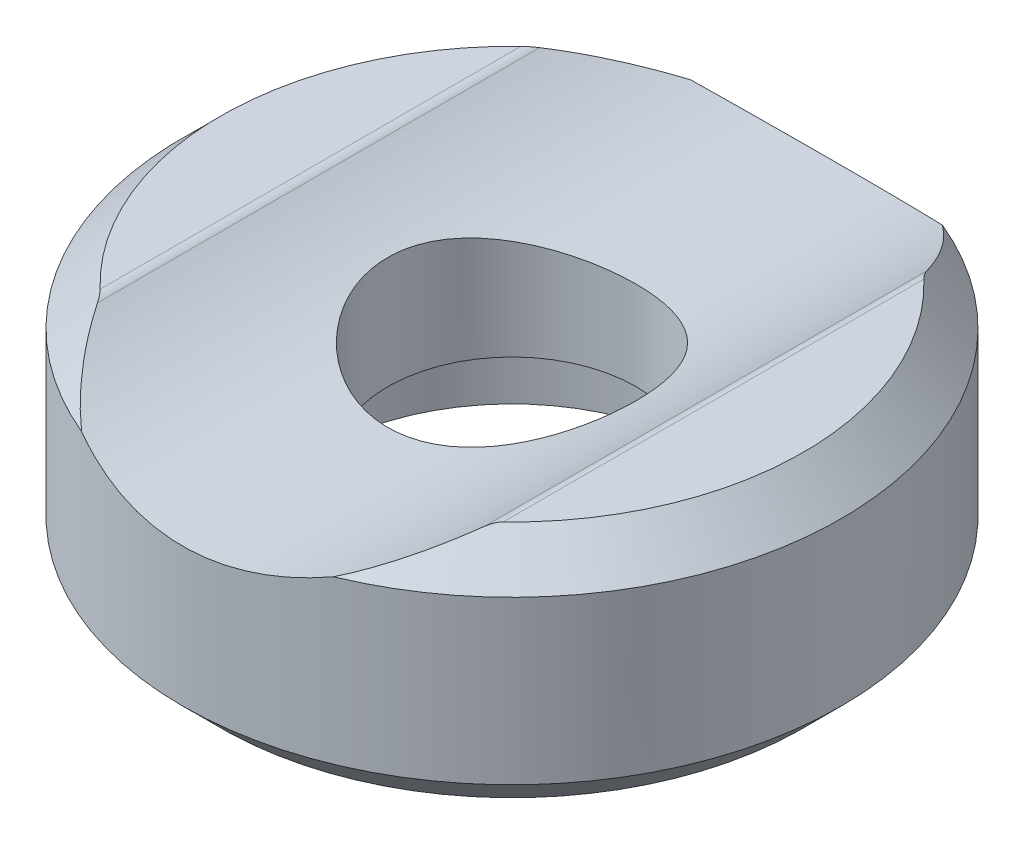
ISO-10303-21;
HEADER;
FILE_DESCRIPTION(('STEP AP214'),'2;1');
FILE_NAME('part.step','',(''),(''),'','','');
FILE_SCHEMA(('AUTOMOTIVE_DESIGN { 1 0 10303 214 1 1 1 1 }'));
ENDSEC;
DATA;
#1=APPLICATION_CONTEXT('core data for automotive mechanical design processes');
#2=APPLICATION_PROTOCOL_DEFINITION('international standard','automotive_design',2000,#1);
#3=PRODUCT_CONTEXT('',#1,'mechanical');
#4=PRODUCT('Part','Part','',(#3));
#5=PRODUCT_RELATED_PRODUCT_CATEGORY('part','',(#4));
#6=PRODUCT_DEFINITION_FORMATION('','',#4);
#7=PRODUCT_DEFINITION_CONTEXT('part definition',#1,'design');
#8=PRODUCT_DEFINITION('design','',#6,#7);
#9=PRODUCT_DEFINITION_SHAPE('','',#8);
#10=(LENGTH_UNIT() NAMED_UNIT(*) SI_UNIT(.MILLI.,.METRE.));
#11=(NAMED_UNIT(*) PLANE_ANGLE_UNIT() SI_UNIT($,.RADIAN.));
#12=(NAMED_UNIT(*) SI_UNIT($,.STERADIAN.) SOLID_ANGLE_UNIT());
#13=UNCERTAINTY_MEASURE_WITH_UNIT(LENGTH_MEASURE(1.E-05),#10,'distance_accuracy_value','');
#14=(GEOMETRIC_REPRESENTATION_CONTEXT(3) GLOBAL_UNCERTAINTY_ASSIGNED_CONTEXT((#13)) GLOBAL_UNIT_ASSIGNED_CONTEXT((#10,
#11,#12)) REPRESENTATION_CONTEXT('',''));
#15=CARTESIAN_POINT('',(0.,0.,0.));
#16=DIRECTION('',(0.,0.,1.));
#17=DIRECTION('',(1.,0.,0.));
#18=AXIS2_PLACEMENT_3D('',#15,#16,#17);
#19=CARTESIAN_POINT('',(6.1,5.,0.));
#20=DIRECTION('',(0.,1.,0.));
#21=DIRECTION('',(0.,0.,1.));
#22=AXIS2_PLACEMENT_3D('',#19,#20,#21);
#23=PLANE('',#22);
#24=CARTESIAN_POINT('',(0.,5.,0.));
#25=DIRECTION('',(0.,-1.,0.));
#26=DIRECTION('',(0.,0.,-1.));
#27=AXIS2_PLACEMENT_3D('',#24,#25,#26);
#28=CIRCLE('',#27,6.1);
#29=CARTESIAN_POINT('',(4.22018956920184,5.,-4.40454310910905));
#30=VERTEX_POINT('',#29);
#31=CARTESIAN_POINT('',(4.22018956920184,5.,4.40454310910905));
#32=VERTEX_POINT('',#31);
#33=EDGE_CURVE('E34',#30,#32,#28,.T.);
#34=ORIENTED_EDGE('',*,*,#33,.F.);
#35=DIRECTION('',(0.,0.,-1.));
#36=VECTOR('',#35,1.);
#37=CARTESIAN_POINT('',(4.22018956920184,5.,7.9));
#38=LINE('',#37,#36);
#39=EDGE_CURVE('E75',#32,#30,#38,.T.);
#40=ORIENTED_EDGE('',*,*,#39,.F.);
#41=EDGE_LOOP('',(#34,#40));
#42=FACE_BOUND('',#41,.T.);
#43=ADVANCED_FACE('F14',(#42),#23,.T.);
#44=CARTESIAN_POINT('',(0.,0.,0.));
#45=DIRECTION('',(0.,-1.,0.));
#46=DIRECTION('',(0.,0.,-1.));
#47=AXIS2_PLACEMENT_3D('',#44,#45,#46);
#48=CYLINDRICAL_SURFACE('',#47,2.6);
#49=CARTESIAN_POINT('',(0.,1.84120486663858,0.));
#50=DIRECTION('',(0.,-1.,0.));
#51=DIRECTION('',(0.,0.,-1.));
#52=AXIS2_PLACEMENT_3D('',#49,#50,#51);
#53=CIRCLE('',#52,2.6);
#54=CARTESIAN_POINT('',(0.,1.84120486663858,-2.6));
#55=VERTEX_POINT('',#54);
#56=EDGE_CURVE('E117',#55,#55,#53,.T.);
#57=ORIENTED_EDGE('',*,*,#56,.T.);
#58=EDGE_LOOP('',(#57));
#59=FACE_BOUND('',#58,.T.);
#60=CARTESIAN_POINT('',(0.,3.7,-2.6));
#61=CARTESIAN_POINT('',(-0.140962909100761,3.70000605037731,-2.59999190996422));
#62=CARTESIAN_POINT('',(-0.282062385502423,3.70418414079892,-2.58848178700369));
#63=CARTESIAN_POINT('',(-0.560216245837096,3.72047005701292,-2.54285009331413));
#64=CARTESIAN_POINT('',(-0.69726390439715,3.73259036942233,-2.5086929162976));
#65=CARTESIAN_POINT('',(-0.963033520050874,3.76344470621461,-2.41912735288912));
#66=CARTESIAN_POINT('',(-1.09177537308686,3.78216217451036,-2.36377213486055));
#67=CARTESIAN_POINT('',(-1.33809338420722,3.82432741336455,-2.23358991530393));
#68=CARTESIAN_POINT('',(-1.45567038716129,3.84777482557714,-2.15876438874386));
#69=CARTESIAN_POINT('',(-1.68107371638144,3.89801392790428,-1.98862772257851));
#70=CARTESIAN_POINT('',(-1.78839600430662,3.92489568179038,-1.89267554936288));
#71=CARTESIAN_POINT('',(-1.98582816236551,3.97851365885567,-1.68436679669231));
#72=CARTESIAN_POINT('',(-2.0759324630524,4.00524983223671,-1.57200492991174));
#73=CARTESIAN_POINT('',(-2.23944197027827,4.05657149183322,-1.32929956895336));
#74=CARTESIAN_POINT('',(-2.31215784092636,4.08104991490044,-1.1984667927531));
#75=CARTESIAN_POINT('',(-2.43433263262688,4.12369987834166,-0.925404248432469));
#76=CARTESIAN_POINT('',(-2.48380013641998,4.1418737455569,-0.783178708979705));
#77=CARTESIAN_POINT('',(-2.5561252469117,4.16890265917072,-0.497128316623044));
#78=CARTESIAN_POINT('',(-2.57993579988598,4.17809016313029,-0.353576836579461));
#79=CARTESIAN_POINT('',(-2.60325097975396,4.18708290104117,-0.0642446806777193));
#80=CARTESIAN_POINT('',(-2.60276474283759,4.1868916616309,0.0815351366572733));
#81=CARTESIAN_POINT('',(-2.57823271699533,4.17743683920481,0.362679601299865));
#82=CARTESIAN_POINT('',(-2.5554806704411,4.16867146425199,0.498176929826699));
#83=CARTESIAN_POINT('',(-2.48919169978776,4.14387952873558,0.763282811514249));
#84=CARTESIAN_POINT('',(-2.44565179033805,4.12785192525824,0.892890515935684));
#85=CARTESIAN_POINT('',(-2.33826565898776,4.09002253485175,1.14528025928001));
#86=CARTESIAN_POINT('',(-2.27406727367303,4.06812179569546,1.26789697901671));
#87=CARTESIAN_POINT('',(-2.12743465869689,4.02105106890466,1.50099824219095));
#88=CARTESIAN_POINT('',(-2.04499534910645,3.99588017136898,1.61147939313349));
#89=CARTESIAN_POINT('',(-1.85821397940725,3.94320396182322,1.82436526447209));
#90=CARTESIAN_POINT('',(-1.75283299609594,3.91565052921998,1.92584855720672));
#91=CARTESIAN_POINT('',(-1.52618194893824,3.86264982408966,2.10999844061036));
#92=CARTESIAN_POINT('',(-1.4049047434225,3.83720350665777,2.19265652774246));
#93=CARTESIAN_POINT('',(-1.14765531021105,3.79083684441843,2.3377343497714));
#94=CARTESIAN_POINT('',(-1.0115003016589,3.76998523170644,2.39985290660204));
#95=CARTESIAN_POINT('',(-0.729873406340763,3.73569358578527,2.49990401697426));
#96=CARTESIAN_POINT('',(-0.584421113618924,3.7222385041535,2.53788570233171));
#97=CARTESIAN_POINT('',(-0.364654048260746,3.70887469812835,2.57534270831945));
#98=CARTESIAN_POINT('',(-0.292083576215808,3.70555752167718,2.5845764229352));
#99=CARTESIAN_POINT('',(-0.146354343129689,3.70111860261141,2.59690716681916));
#100=CARTESIAN_POINT('',(-0.0731955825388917,3.69999685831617,2.60000420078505));
#101=CARTESIAN_POINT('',(0.140962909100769,3.70000605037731,2.59999190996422));
#102=CARTESIAN_POINT('',(0.282062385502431,3.70418414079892,2.58848178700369));
#103=CARTESIAN_POINT('',(0.560216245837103,3.72047005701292,2.54285009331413));
#104=CARTESIAN_POINT('',(0.697263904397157,3.73259036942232,2.5086929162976));
#105=CARTESIAN_POINT('',(0.963033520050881,3.7634447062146,2.41912735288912));
#106=CARTESIAN_POINT('',(1.09177537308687,3.78216217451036,2.36377213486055));
#107=CARTESIAN_POINT('',(1.33809338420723,3.82432741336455,2.23358991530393));
#108=CARTESIAN_POINT('',(1.4556703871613,3.84777482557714,2.15876438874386));
#109=CARTESIAN_POINT('',(1.68107371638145,3.89801392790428,1.9886277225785));
#110=CARTESIAN_POINT('',(1.78839600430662,3.92489568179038,1.89267554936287));
#111=CARTESIAN_POINT('',(1.98582816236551,3.97851365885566,1.68436679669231));
#112=CARTESIAN_POINT('',(2.0759324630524,4.00524983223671,1.57200492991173));
#113=CARTESIAN_POINT('',(2.23944197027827,4.05657149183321,1.32929956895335));
#114=CARTESIAN_POINT('',(2.31215784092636,4.08104991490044,1.19846679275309));
#115=CARTESIAN_POINT('',(2.43433263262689,4.12369987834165,0.925404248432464));
#116=CARTESIAN_POINT('',(2.48380013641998,4.14187374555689,0.783178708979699));
#117=CARTESIAN_POINT('',(2.5561252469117,4.16890265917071,0.497128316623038));
#118=CARTESIAN_POINT('',(2.57993579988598,4.17809016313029,0.353576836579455));
#119=CARTESIAN_POINT('',(2.60325097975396,4.18708290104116,0.0642446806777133));
#120=CARTESIAN_POINT('',(2.60276474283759,4.18689166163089,-0.081535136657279));
#121=CARTESIAN_POINT('',(2.57823271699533,4.17743683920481,-0.36267960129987));
#122=CARTESIAN_POINT('',(2.55548067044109,4.16867146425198,-0.498176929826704));
#123=CARTESIAN_POINT('',(2.48919169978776,4.14387952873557,-0.763282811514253));
#124=CARTESIAN_POINT('',(2.44565179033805,4.12785192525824,-0.892890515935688));
#125=CARTESIAN_POINT('',(2.33826565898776,4.09002253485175,-1.14528025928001));
#126=CARTESIAN_POINT('',(2.27406727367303,4.06812179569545,-1.26789697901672));
#127=CARTESIAN_POINT('',(2.12743465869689,4.02105106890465,-1.50099824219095));
#128=CARTESIAN_POINT('',(2.04499534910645,3.99588017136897,-1.6114793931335));
#129=CARTESIAN_POINT('',(1.85821397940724,3.94320396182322,-1.82436526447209));
#130=CARTESIAN_POINT('',(1.75283299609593,3.91565052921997,-1.92584855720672));
#131=CARTESIAN_POINT('',(1.52618194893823,3.86264982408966,-2.10999844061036));
#132=CARTESIAN_POINT('',(1.40490474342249,3.83720350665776,-2.19265652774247));
#133=CARTESIAN_POINT('',(1.14765531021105,3.79083684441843,-2.3377343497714));
#134=CARTESIAN_POINT('',(1.01150030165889,3.76998523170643,-2.39985290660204));
#135=CARTESIAN_POINT('',(0.729873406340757,3.73569358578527,-2.49990401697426));
#136=CARTESIAN_POINT('',(0.584421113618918,3.7222385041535,-2.53788570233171));
#137=CARTESIAN_POINT('',(0.364654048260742,3.70887469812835,-2.57534270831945));
#138=CARTESIAN_POINT('',(0.292083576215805,3.70555752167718,-2.5845764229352));
#139=CARTESIAN_POINT('',(0.146354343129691,3.70111860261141,-2.59690716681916));
#140=CARTESIAN_POINT('',(0.0731955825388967,3.69999685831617,-2.60000420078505));
#141=CARTESIAN_POINT('',(0.,3.7,-2.6));
#142=B_SPLINE_CURVE_WITH_KNOTS('',3,(#60,#61,#62,#63,#64,#65,#66,#67,#68,#69,#70,#71,#72,#73,
#74,#75,#76,#77,#78,#79,#80,#81,#82,#83,#84,#85,#86,#87,#88,#89,#90,#91,#92,#93,#94,#95,#96,#97,
#98,#99,#100,#101,#102,#103,#104,#105,#106,#107,#108,#109,#110,#111,#112,#113,#114,#115,#116,
#117,#118,#119,#120,#121,#122,#123,#124,#125,#126,#127,#128,#129,#130,#131,#132,#133,#134,#135,
#136,#137,#138,#139,#140,#141),.UNSPECIFIED.,.T.,.F.,(4,2,2,2,2,2,2,2,2,2,2,2,2,2,2,2,2,2,2,2,2,
2,2,2,2,2,2,2,2,2,2,2,2,2,2,2,2,2,2,2,4),(0.,0.422605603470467,0.845877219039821,
1.26809407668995,1.6902789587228,2.12767719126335,2.56521666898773,3.0179651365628,
3.47054632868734,3.90566763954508,4.34062533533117,4.75172489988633,5.16288352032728,
5.58145960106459,6.00015239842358,6.44472715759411,6.88950233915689,7.34053671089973,
7.79065001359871,8.01008991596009,8.22952965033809,8.65213525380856,9.07540686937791,
9.49762372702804,9.91980860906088,10.3572068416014,10.7947463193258,11.2474947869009,
11.7000759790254,12.1351972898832,12.5701549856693,12.9812545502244,13.3924131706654,
13.8109892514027,14.2296820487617,14.6742568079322,15.119031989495,15.5700663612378,
16.0201796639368,16.2396195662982,16.4590593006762),.UNSPECIFIED.);
#143=CARTESIAN_POINT('',(0.,3.7,-2.6));
#144=VERTEX_POINT('',#143);
#145=EDGE_CURVE('E96',#144,#144,#142,.T.);
#146=ORIENTED_EDGE('',*,*,#145,.T.);
#147=EDGE_LOOP('',(#146));
#148=FACE_BOUND('',#147,.T.);
#149=ADVANCED_FACE('F190',(#59,#148),#48,.F.);
#150=CARTESIAN_POINT('',(0.,0.,0.));
#151=DIRECTION('',(0.,-1.,0.));
#152=DIRECTION('',(0.,0.,-1.));
#153=AXIS2_PLACEMENT_3D('',#150,#151,#152);
#154=CYLINDRICAL_SURFACE('',#153,6.9);
#155=CARTESIAN_POINT('',(-2.63628526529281,4.2,-6.37651942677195));
#156=CARTESIAN_POINT('',(-2.50604413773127,4.14873605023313,-6.43038253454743));
#157=CARTESIAN_POINT('',(-2.37298216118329,4.10078254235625,-6.48070582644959));
#158=CARTESIAN_POINT('',(-2.10169319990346,4.01209649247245,-6.57369114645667));
#159=CARTESIAN_POINT('',(-1.96346058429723,3.97137211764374,-6.6163445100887));
#160=CARTESIAN_POINT('',(-1.68295064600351,3.89795362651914,-6.69318911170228));
#161=CARTESIAN_POINT('',(-1.54068420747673,3.86523984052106,-6.72740107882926));
#162=CARTESIAN_POINT('',(-1.25272939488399,3.80830128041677,-6.78691875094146));
#163=CARTESIAN_POINT('',(-1.10704340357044,3.78407077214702,-6.81223047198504));
#164=CARTESIAN_POINT('',(-0.802040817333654,3.7430345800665,-6.85508535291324));
#165=CARTESIAN_POINT('',(-0.642525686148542,3.7269277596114,-6.8718975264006));
#166=CARTESIAN_POINT('',(-0.322004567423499,3.70541128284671,-6.89435401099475));
#167=CARTESIAN_POINT('',(-0.160998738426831,3.70000050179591,-6.89999949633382));
#168=CARTESIAN_POINT('',(0.149636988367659,3.69999953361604,-6.90000046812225));
#169=CARTESIAN_POINT('',(0.29926785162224,3.70467267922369,-6.89512457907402));
#170=CARTESIAN_POINT('',(0.597387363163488,3.72327077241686,-6.87571451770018));
#171=CARTESIAN_POINT('',(0.745875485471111,3.73719974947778,-6.8611761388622));
#172=CARTESIAN_POINT('',(1.04078507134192,3.77406888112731,-6.82267727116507));
#173=CARTESIAN_POINT('',(1.18720188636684,3.79702673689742,-6.79869827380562));
#174=CARTESIAN_POINT('',(1.47659213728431,3.85149979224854,-6.74176705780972));
#175=CARTESIAN_POINT('',(1.61956675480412,3.88301200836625,-6.70881796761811));
#176=CARTESIAN_POINT('',(1.91220551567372,3.95680499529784,-6.63159845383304));
#177=CARTESIAN_POINT('',(2.06152582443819,3.99973239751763,-6.58664711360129));
#178=CARTESIAN_POINT('',(2.35372885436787,4.09386304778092,-6.4879666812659));
#179=CARTESIAN_POINT('',(2.49663793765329,4.14502747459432,-6.43427875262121));
#180=CARTESIAN_POINT('',(2.63628526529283,4.2,-6.37651942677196));
#181=B_SPLINE_CURVE_WITH_KNOTS('',3,(#155,#156,#157,#158,#159,#160,#161,#162,#163,#164,#165,
#166,#167,#168,#169,#170,#171,#172,#173,#174,#175,#176,#177,#178,#179,#180),.UNSPECIFIED.,.F.,
.F.,(4,2,2,2,2,2,2,2,2,2,2,2,4),(0.,0.449885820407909,0.900276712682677,1.34955034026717,
1.79851969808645,2.28139309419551,2.76421571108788,3.21296532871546,3.66191043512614,
4.11174012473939,4.56141313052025,5.04603822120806,5.52844275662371),.UNSPECIFIED.);
#182=CARTESIAN_POINT('',(-2.63628526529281,4.2,-6.37651942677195));
#183=VERTEX_POINT('',#182);
#184=CARTESIAN_POINT('',(2.63628526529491,4.20000000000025,-6.37651942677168));
#185=VERTEX_POINT('',#184);
#186=EDGE_CURVE('E181',#183,#185,#181,.T.);
#187=ORIENTED_EDGE('',*,*,#186,.T.);
#188=CARTESIAN_POINT('',(0.,4.2,0.));
#189=DIRECTION('',(0.,-1.,0.));
#190=DIRECTION('',(0.,0.,-1.));
#191=AXIS2_PLACEMENT_3D('',#188,#189,#190);
#192=CIRCLE('',#191,6.9);
#193=CARTESIAN_POINT('',(2.63628526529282,4.2,6.37651942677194));
#194=VERTEX_POINT('',#193);
#195=EDGE_CURVE('E93',#185,#194,#192,.T.);
#196=ORIENTED_EDGE('',*,*,#195,.T.);
#197=CARTESIAN_POINT('',(2.63628526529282,4.2,6.37651942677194));
#198=CARTESIAN_POINT('',(2.50604413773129,4.14873605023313,6.43038253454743));
#199=CARTESIAN_POINT('',(2.37298216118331,4.10078254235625,6.48070582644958));
#200=CARTESIAN_POINT('',(2.10169319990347,4.01209649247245,6.57369114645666));
#201=CARTESIAN_POINT('',(1.96346058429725,3.97137211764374,6.6163445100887));
#202=CARTESIAN_POINT('',(1.68295064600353,3.89795362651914,6.69318911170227));
#203=CARTESIAN_POINT('',(1.54068420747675,3.86523984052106,6.72740107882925));
#204=CARTESIAN_POINT('',(1.25272939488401,3.80830128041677,6.78691875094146));
#205=CARTESIAN_POINT('',(1.10704340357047,3.78407077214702,6.81223047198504));
#206=CARTESIAN_POINT('',(0.802040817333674,3.7430345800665,6.85508535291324));
#207=CARTESIAN_POINT('',(0.64252568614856,3.7269277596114,6.8718975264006));
#208=CARTESIAN_POINT('',(0.322004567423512,3.70541128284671,6.89435401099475));
#209=CARTESIAN_POINT('',(0.160998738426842,3.70000050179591,6.89999949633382));
#210=CARTESIAN_POINT('',(-0.149636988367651,3.69999953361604,6.90000046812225));
#211=CARTESIAN_POINT('',(-0.299267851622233,3.70467267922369,6.89512457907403));
#212=CARTESIAN_POINT('',(-0.59738736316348,3.72327077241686,6.87571451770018));
#213=CARTESIAN_POINT('',(-0.745875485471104,3.73719974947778,6.8611761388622));
#214=CARTESIAN_POINT('',(-1.04078507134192,3.77406888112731,6.82267727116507));
#215=CARTESIAN_POINT('',(-1.18720188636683,3.79702673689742,6.79869827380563));
#216=CARTESIAN_POINT('',(-1.4765921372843,3.85149979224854,6.74176705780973));
#217=CARTESIAN_POINT('',(-1.61956675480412,3.88301200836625,6.70881796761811));
#218=CARTESIAN_POINT('',(-1.91220551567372,3.95680499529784,6.63159845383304));
#219=CARTESIAN_POINT('',(-2.06152582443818,3.99973239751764,6.5866471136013));
#220=CARTESIAN_POINT('',(-2.35372885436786,4.09386304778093,6.4879666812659));
#221=CARTESIAN_POINT('',(-2.49663793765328,4.14502747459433,6.43427875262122));
#222=CARTESIAN_POINT('',(-2.63628526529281,4.2,6.37651942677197));
#223=B_SPLINE_CURVE_WITH_KNOTS('',3,(#197,#198,#199,#200,#201,#202,#203,#204,#205,#206,#207,
#208,#209,#210,#211,#212,#213,#214,#215,#216,#217,#218,#219,#220,#221,#222),.UNSPECIFIED.,.F.,
.F.,(4,2,2,2,2,2,2,2,2,2,2,2,4),(0.,0.449885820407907,0.900276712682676,1.34955034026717,
1.79851969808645,2.28139309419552,2.76421571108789,3.21296532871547,3.66191043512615,
4.1117401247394,4.56141313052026,5.04603822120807,5.52844275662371),.UNSPECIFIED.);
#224=CARTESIAN_POINT('',(-2.63628526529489,4.20000000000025,6.37651942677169));
#225=VERTEX_POINT('',#224);
#226=EDGE_CURVE('E175',#194,#225,#223,.T.);
#227=ORIENTED_EDGE('',*,*,#226,.T.);
#228=EDGE_CURVE('E89',#225,#183,#192,.T.);
#229=ORIENTED_EDGE('',*,*,#228,.T.);
#230=EDGE_LOOP('',(#187,#196,#227,#229));
#231=FACE_BOUND('',#230,.T.);
#232=CARTESIAN_POINT('',(0.,0.8,0.));
#233=DIRECTION('',(0.,-1.,0.));
#234=DIRECTION('',(0.,0.,-1.));
#235=AXIS2_PLACEMENT_3D('',#232,#233,#234);
#236=CIRCLE('',#235,6.9);
#237=CARTESIAN_POINT('',(0.,0.8,-6.9));
#238=VERTEX_POINT('',#237);
#239=EDGE_CURVE('E105',#238,#238,#236,.T.);
#240=ORIENTED_EDGE('',*,*,#239,.F.);
#241=EDGE_LOOP('',(#240));
#242=FACE_BOUND('',#241,.T.);
#243=ADVANCED_FACE('F186',(#231,#242),#154,.T.);
#244=CARTESIAN_POINT('',(0.,4.2,0.));
#245=DIRECTION('',(0.,-1.,0.));
#246=DIRECTION('',(0.,0.,-1.));
#247=AXIS2_PLACEMENT_3D('',#244,#245,#246);
#248=CONICAL_SURFACE('',#247,6.9,0.785398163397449);
#249=ORIENTED_EDGE('',*,*,#195,.F.);
#250=CARTESIAN_POINT('',(1.7947559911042,3.92727808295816,-6.94455114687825));
#251=CARTESIAN_POINT('',(1.9082883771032,3.95650382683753,-6.885017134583));
#252=CARTESIAN_POINT('',(2.01861183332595,3.9878530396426,-6.82076873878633));
#253=CARTESIAN_POINT('',(2.23270702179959,4.05401162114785,-6.6840113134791));
#254=CARTESIAN_POINT('',(2.3364876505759,4.08881611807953,-6.61151389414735));
#255=CARTESIAN_POINT('',(2.70272836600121,4.22055154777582,-6.33434783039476));
#256=CARTESIAN_POINT('',(2.94616325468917,4.32572211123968,-6.10798365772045));
#257=CARTESIAN_POINT('',(3.27925401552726,4.48892745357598,-5.74257224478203));
#258=CARTESIAN_POINT('',(3.38510848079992,4.54434629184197,-5.61619679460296));
#259=CARTESIAN_POINT('',(3.58670944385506,4.6559015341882,-5.35591838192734));
#260=CARTESIAN_POINT('',(3.68246057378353,4.71203759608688,-5.22201891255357));
#261=CARTESIAN_POINT('',(3.84332078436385,4.81102382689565,-4.97938574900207));
#262=CARTESIAN_POINT('',(3.91040266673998,4.85395115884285,-4.87197332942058));
#263=CARTESIAN_POINT('',(4.03901532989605,4.9391027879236,-4.65373209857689));
#264=CARTESIAN_POINT('',(4.10055030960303,4.98132759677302,-4.54290595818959));
#265=CARTESIAN_POINT('',(4.26736511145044,5.09938847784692,-4.22436484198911));
#266=CARTESIAN_POINT('',(4.36638176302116,5.17392079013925,-4.0128487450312));
#267=CARTESIAN_POINT('',(4.54737879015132,5.31657555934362,-3.58039486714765));
#268=CARTESIAN_POINT('',(4.62934570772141,5.3846929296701,-3.35944980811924));
#269=CARTESIAN_POINT('',(4.77660532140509,5.51172576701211,-2.90944447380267));
#270=CARTESIAN_POINT('',(4.84189497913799,5.57063955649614,-2.68038272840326));
#271=CARTESIAN_POINT('',(4.95585153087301,5.67643841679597,-2.21560179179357));
#272=CARTESIAN_POINT('',(5.00453381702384,5.72333461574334,-1.97988898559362));
#273=CARTESIAN_POINT('',(5.06021813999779,5.77802333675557,-1.6510180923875));
#274=CARTESIAN_POINT('',(5.07435432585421,5.79203921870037,-1.56003706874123));
#275=CARTESIAN_POINT('',(5.10018711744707,5.81783288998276,-1.3775665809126));
#276=CARTESIAN_POINT('',(5.11188761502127,5.82961424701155,-1.28607817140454));
#277=CARTESIAN_POINT('',(5.1223796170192,5.84023448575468,-1.19430327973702));
#278=B_SPLINE_CURVE_WITH_KNOTS('',3,(#250,#251,#252,#253,#254,#255,#256,#257,#258,#259,#260,
#261,#262,#263,#264,#265,#266,#267,#268,#269,#270,#271,#272,#273,#274,#275,#276,#277),
.UNSPECIFIED.,.F.,.F.,(4,2,2,2,2,2,2,2,2,2,2,2,2,4),(0.,0.394038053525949,0.787528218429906,
1.82662607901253,2.34812985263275,2.86939348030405,3.2703936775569,3.67108772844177,
4.40558841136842,5.1406666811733,5.8758787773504,6.6104075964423,6.88975929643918,
7.1686611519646),.UNSPECIFIED.);
#279=CARTESIAN_POINT('',(4.05138198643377,4.948,-4.62962287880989));
#280=VERTEX_POINT('',#279);
#281=EDGE_CURVE('E82',#185,#280,#278,.T.);
#282=ORIENTED_EDGE('',*,*,#281,.T.);
#283=CARTESIAN_POINT('',(4.23727032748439,4.99951335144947,-4.38878998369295));
#284=CARTESIAN_POINT('',(4.22768475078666,5.00005372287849,-4.39729392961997));
#285=CARTESIAN_POINT('',(4.2183801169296,5.00012956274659,-4.40611545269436));
#286=CARTESIAN_POINT('',(4.20031344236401,4.99947842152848,-4.4242392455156));
#287=CARTESIAN_POINT('',(4.19155039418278,4.99875298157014,-4.43354055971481));
#288=CARTESIAN_POINT('',(4.16622800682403,4.99559298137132,-4.46172127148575));
#289=CARTESIAN_POINT('',(4.15037198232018,4.99218247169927,-4.4811208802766));
#290=CARTESIAN_POINT('',(4.11807763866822,4.98266168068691,-4.52372172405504));
#291=CARTESIAN_POINT('',(4.1019153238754,4.9762205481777,-4.54705349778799));
#292=CARTESIAN_POINT('',(4.07907823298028,4.96487925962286,-4.58268660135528));
#293=CARTESIAN_POINT('',(4.07164520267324,4.96077808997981,-4.5947721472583));
#294=CARTESIAN_POINT('',(4.05729566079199,4.95206321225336,-4.61905383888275));
#295=CARTESIAN_POINT('',(4.05037883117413,4.94744982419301,-4.63124991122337));
#296=CARTESIAN_POINT('',(4.04370942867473,4.94260000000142,-4.64348886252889));
#297=B_SPLINE_CURVE_WITH_KNOTS('',3,(#283,#284,#285,#286,#287,#288,#289,#290,#291,#292,#293,
#294,#295,#296),.UNSPECIFIED.,.F.,.F.,(4,2,2,2,2,2,4),(0.,0.0384323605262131,0.0767909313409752,
0.152442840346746,0.239561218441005,0.283854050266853,0.32811936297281),.UNSPECIFIED.);
#298=EDGE_CURVE('E88',#30,#280,#297,.T.);
#299=ORIENTED_EDGE('',*,*,#298,.F.);
#300=ORIENTED_EDGE('',*,*,#33,.T.);
#301=CARTESIAN_POINT('',(4.04370942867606,4.9426,4.64348886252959));
#302=CARTESIAN_POINT('',(4.05272650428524,4.94914992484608,4.62695137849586));
#303=CARTESIAN_POINT('',(4.06219403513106,4.95527778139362,4.61047999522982));
#304=CARTESIAN_POINT('',(4.08210626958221,4.96658171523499,4.57772476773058));
#305=CARTESIAN_POINT('',(4.09255408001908,4.97175460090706,4.56144171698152));
#306=CARTESIAN_POINT('',(4.11417361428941,4.98088189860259,4.52962716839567));
#307=CARTESIAN_POINT('',(4.12532102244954,4.98486329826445,4.51408704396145));
#308=CARTESIAN_POINT('',(4.14861880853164,4.99158961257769,4.48352503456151));
#309=CARTESIAN_POINT('',(4.16076769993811,4.99433632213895,4.46850242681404));
#310=CARTESIAN_POINT('',(4.18334323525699,4.99789707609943,4.44246816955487));
#311=CARTESIAN_POINT('',(4.19355007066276,4.9990054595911,4.43130893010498));
#312=CARTESIAN_POINT('',(4.21479051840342,5.00013851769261,4.40954489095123));
#313=CARTESIAN_POINT('',(4.22583108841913,5.00015275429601,4.39894639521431));
#314=CARTESIAN_POINT('',(4.23727032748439,4.99951335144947,4.38878998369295));
#315=B_SPLINE_CURVE_WITH_KNOTS('',3,(#301,#302,#303,#304,#305,#306,#307,#308,#309,#310,#311,
#312,#313,#314),.UNSPECIFIED.,.F.,.F.,(4,2,2,2,2,2,4),(0.,0.0598327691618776,0.119862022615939,
0.178405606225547,0.236863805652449,0.282290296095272,0.328150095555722),.UNSPECIFIED.);
#316=CARTESIAN_POINT('',(4.05138198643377,4.948,4.62962287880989));
#317=VERTEX_POINT('',#316);
#318=EDGE_CURVE('E73',#317,#32,#315,.T.);
#319=ORIENTED_EDGE('',*,*,#318,.F.);
#320=CARTESIAN_POINT('',(4.15943157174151,5.023,4.43046927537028));
#321=CARTESIAN_POINT('',(4.06438742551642,4.95577552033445,4.6118253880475));
#322=CARTESIAN_POINT('',(3.96245664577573,4.88705327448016,4.78918990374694));
#323=CARTESIAN_POINT('',(3.74351350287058,4.74832484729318,5.13490951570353));
#324=CARTESIAN_POINT('',(3.62644219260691,4.67831461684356,5.30322555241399));
#325=CARTESIAN_POINT('',(3.37947887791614,4.540863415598,5.62466674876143));
#326=CARTESIAN_POINT('',(3.2499360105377,4.47340012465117,5.77804908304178));
#327=CARTESIAN_POINT('',(2.97516947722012,4.34168316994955,6.07117271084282));
#328=CARTESIAN_POINT('',(2.82997908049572,4.27742310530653,6.21094178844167));
#329=CARTESIAN_POINT('',(2.63779877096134,4.20046551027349,6.37557535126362));
#330=CARTESIAN_POINT('',(2.59847123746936,4.18510868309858,6.4082806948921));
#331=CARTESIAN_POINT('',(2.51863998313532,4.15475859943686,6.47265295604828));
#332=CARTESIAN_POINT('',(2.4781332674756,4.1397664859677,6.50431669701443));
#333=CARTESIAN_POINT('',(2.43708329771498,4.12499999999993,6.53538445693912));
#334=B_SPLINE_CURVE_WITH_KNOTS('',3,(#320,#321,#322,#323,#324,#325,#326,#327,#328,#329,#330,
#331,#332,#333),.UNSPECIFIED.,.F.,.F.,(4,2,2,2,2,2,4),(0.,0.646591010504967,1.29577979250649,
1.93031146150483,2.56351967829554,2.72371819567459,2.88436691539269),.UNSPECIFIED.);
#335=EDGE_CURVE('E81',#317,#194,#334,.T.);
#336=ORIENTED_EDGE('',*,*,#335,.T.);
#337=EDGE_LOOP('',(#249,#282,#299,#300,#319,#336));
#338=FACE_BOUND('',#337,.T.);
#339=ADVANCED_FACE('F86',(#338),#248,.T.);
#340=DIRECTION('',(0.,0.,-1.));
#341=VECTOR('',#340,1.);
#342=CARTESIAN_POINT('',(-4.22018956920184,5.,7.9));
#343=LINE('',#342,#341);
#344=CARTESIAN_POINT('',(-4.22018956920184,5.,4.40454310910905));
#345=VERTEX_POINT('',#344);
#346=CARTESIAN_POINT('',(-4.22018956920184,5.,-4.40454310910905));
#347=VERTEX_POINT('',#346);
#348=EDGE_CURVE('E232',#345,#347,#343,.T.);
#349=ORIENTED_EDGE('',*,*,#348,.T.);
#350=EDGE_CURVE('E90',#345,#347,#28,.T.);
#351=ORIENTED_EDGE('',*,*,#350,.F.);
#352=EDGE_LOOP('',(#349,#351));
#353=FACE_BOUND('',#352,.T.);
#354=ADVANCED_FACE('F16',(#353),#23,.T.);
#355=CARTESIAN_POINT('',(0.,1.84120486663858,0.));
#356=DIRECTION('',(0.,-1.,0.));
#357=DIRECTION('',(0.,0.,-1.));
#358=AXIS2_PLACEMENT_3D('',#355,#356,#357);
#359=CONICAL_SURFACE('',#358,2.6,1.02974425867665);
#360=CARTESIAN_POINT('',(0.,1.,0.));
#361=DIRECTION('',(0.,-1.,0.));
#362=DIRECTION('',(0.,0.,-1.));
#363=AXIS2_PLACEMENT_3D('',#360,#361,#362);
#364=CIRCLE('',#363,4.);
#365=CARTESIAN_POINT('',(0.,1.,-4.));
#366=VERTEX_POINT('',#365);
#367=EDGE_CURVE('E114',#366,#366,#364,.T.);
#368=ORIENTED_EDGE('',*,*,#367,.T.);
#369=EDGE_LOOP('',(#368));
#370=FACE_BOUND('',#369,.T.);
#371=ORIENTED_EDGE('',*,*,#56,.F.);
#372=EDGE_LOOP('',(#371));
#373=FACE_BOUND('',#372,.T.);
#374=ADVANCED_FACE('F204',(#370,#373),#359,.F.);
#375=CARTESIAN_POINT('',(0.,0.,0.));
#376=DIRECTION('',(0.,-1.,0.));
#377=DIRECTION('',(0.,0.,-1.));
#378=AXIS2_PLACEMENT_3D('',#375,#376,#377);
#379=CYLINDRICAL_SURFACE('',#378,4.);
#380=CARTESIAN_POINT('',(0.,0.,0.));
#381=DIRECTION('',(0.,-1.,0.));
#382=DIRECTION('',(0.,0.,-1.));
#383=AXIS2_PLACEMENT_3D('',#380,#381,#382);
#384=CIRCLE('',#383,4.);
#385=CARTESIAN_POINT('',(0.,0.,-4.));
#386=VERTEX_POINT('',#385);
#387=EDGE_CURVE('E111',#386,#386,#384,.T.);
#388=ORIENTED_EDGE('',*,*,#387,.T.);
#389=EDGE_LOOP('',(#388));
#390=FACE_BOUND('',#389,.T.);
#391=ORIENTED_EDGE('',*,*,#367,.F.);
#392=EDGE_LOOP('',(#391));
#393=FACE_BOUND('',#392,.T.);
#394=ADVANCED_FACE('F200',(#390,#393),#379,.F.);
#395=CARTESIAN_POINT('',(4.,0.,0.));
#396=DIRECTION('',(0.,-1.,0.));
#397=DIRECTION('',(0.,0.,-1.));
#398=AXIS2_PLACEMENT_3D('',#395,#396,#397);
#399=PLANE('',#398);
#400=CARTESIAN_POINT('',(0.,0.,0.));
#401=DIRECTION('',(0.,-1.,0.));
#402=DIRECTION('',(0.,0.,-1.));
#403=AXIS2_PLACEMENT_3D('',#400,#401,#402);
#404=CIRCLE('',#403,6.1);
#405=CARTESIAN_POINT('',(0.,0.,-6.1));
#406=VERTEX_POINT('',#405);
#407=EDGE_CURVE('E108',#406,#406,#404,.T.);
#408=ORIENTED_EDGE('',*,*,#407,.T.);
#409=EDGE_LOOP('',(#408));
#410=FACE_BOUND('',#409,.T.);
#411=ORIENTED_EDGE('',*,*,#387,.F.);
#412=EDGE_LOOP('',(#411));
#413=FACE_BOUND('',#412,.T.);
#414=ADVANCED_FACE('F196',(#410,#413),#399,.T.);
#415=CARTESIAN_POINT('',(0.,0.,0.));
#416=DIRECTION('',(0.,1.,0.));
#417=DIRECTION('',(0.,0.,1.));
#418=AXIS2_PLACEMENT_3D('',#415,#416,#417);
#419=CONICAL_SURFACE('',#418,6.1,0.785398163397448);
#420=ORIENTED_EDGE('',*,*,#239,.T.);
#421=EDGE_LOOP('',(#420));
#422=FACE_BOUND('',#421,.T.);
#423=ORIENTED_EDGE('',*,*,#407,.F.);
#424=EDGE_LOOP('',(#423));
#425=FACE_BOUND('',#424,.T.);
#426=ADVANCED_FACE('F192',(#422,#425),#419,.T.);
#427=CARTESIAN_POINT('',(-4.04370942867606,4.9426,-4.6434888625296));
#428=CARTESIAN_POINT('',(-4.05272650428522,4.94914992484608,-4.62695137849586));
#429=CARTESIAN_POINT('',(-4.06219403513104,4.95527778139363,-4.61047999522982));
#430=CARTESIAN_POINT('',(-4.08210626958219,4.966581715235,-4.57772476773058));
#431=CARTESIAN_POINT('',(-4.09255408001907,4.97175460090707,-4.56144171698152));
#432=CARTESIAN_POINT('',(-4.1141736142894,4.9808818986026,-4.52962716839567));
#433=CARTESIAN_POINT('',(-4.12532102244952,4.98486329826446,-4.51408704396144));
#434=CARTESIAN_POINT('',(-4.14861880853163,4.9915896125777,-4.48352503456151));
#435=CARTESIAN_POINT('',(-4.16076769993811,4.99433632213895,-4.46850242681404));
#436=CARTESIAN_POINT('',(-4.18334323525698,4.99789707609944,-4.44246816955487));
#437=CARTESIAN_POINT('',(-4.19355007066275,4.99900545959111,-4.43130893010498));
#438=CARTESIAN_POINT('',(-4.21479051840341,5.00013851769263,-4.40954489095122));
#439=CARTESIAN_POINT('',(-4.22583108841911,5.00015275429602,-4.3989463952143));
#440=CARTESIAN_POINT('',(-4.23727032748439,4.99951335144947,-4.38878998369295));
#441=B_SPLINE_CURVE_WITH_KNOTS('',3,(#427,#428,#429,#430,#431,#432,#433,#434,#435,#436,#437,
#438,#439,#440),.UNSPECIFIED.,.F.,.F.,(4,2,2,2,2,2,4),(0.,0.059832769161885,0.119862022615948,
0.178405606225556,0.236863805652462,0.282290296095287,0.328150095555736),.UNSPECIFIED.);
#442=CARTESIAN_POINT('',(-4.05138198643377,4.948,-4.6296228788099));
#443=VERTEX_POINT('',#442);
#444=EDGE_CURVE('E9',#443,#347,#441,.T.);
#445=ORIENTED_EDGE('',*,*,#444,.F.);
#446=CARTESIAN_POINT('',(-4.15943157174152,5.023,-4.43046927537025));
#447=CARTESIAN_POINT('',(-4.06438742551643,4.95577552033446,-4.61182538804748));
#448=CARTESIAN_POINT('',(-3.96245664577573,4.88705327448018,-4.78918990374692));
#449=CARTESIAN_POINT('',(-3.74351350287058,4.7483248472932,-5.13490951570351));
#450=CARTESIAN_POINT('',(-3.62644219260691,4.67831461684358,-5.30322555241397));
#451=CARTESIAN_POINT('',(-3.37947887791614,4.54086341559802,-5.62466674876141));
#452=CARTESIAN_POINT('',(-3.2499360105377,4.47340012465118,-5.77804908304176));
#453=CARTESIAN_POINT('',(-2.97516947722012,4.34168316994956,-6.0711727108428));
#454=CARTESIAN_POINT('',(-2.82997908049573,4.27742310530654,-6.21094178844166));
#455=CARTESIAN_POINT('',(-2.63779877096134,4.2004655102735,-6.37557535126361));
#456=CARTESIAN_POINT('',(-2.59847123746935,4.18510868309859,-6.40828069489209));
#457=CARTESIAN_POINT('',(-2.51863998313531,4.15475859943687,-6.47265295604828));
#458=CARTESIAN_POINT('',(-2.47813326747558,4.13976648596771,-6.50431669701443));
#459=CARTESIAN_POINT('',(-2.43708329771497,4.12499999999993,-6.53538445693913));
#460=B_SPLINE_CURVE_WITH_KNOTS('',3,(#446,#447,#448,#449,#450,#451,#452,#453,#454,#455,#456,
#457,#458,#459),.UNSPECIFIED.,.F.,.F.,(4,2,2,2,2,2,4),(0.,0.646591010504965,1.2957797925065,
1.93031146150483,2.56351967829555,2.72371819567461,2.88436691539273),.UNSPECIFIED.);
#461=EDGE_CURVE('E28',#443,#183,#460,.T.);
#462=ORIENTED_EDGE('',*,*,#461,.T.);
#463=ORIENTED_EDGE('',*,*,#228,.F.);
#464=CARTESIAN_POINT('',(-1.79475599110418,3.92727808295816,6.94455114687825));
#465=CARTESIAN_POINT('',(-1.90828837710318,3.95650382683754,6.88501713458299));
#466=CARTESIAN_POINT('',(-2.01861183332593,3.98785303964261,6.82076873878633));
#467=CARTESIAN_POINT('',(-2.23270702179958,4.05401162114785,6.6840113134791));
#468=CARTESIAN_POINT('',(-2.33648765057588,4.08881611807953,6.61151389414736));
#469=CARTESIAN_POINT('',(-2.70272836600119,4.22055154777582,6.33434783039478));
#470=CARTESIAN_POINT('',(-2.94616325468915,4.32572211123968,6.10798365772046));
#471=CARTESIAN_POINT('',(-3.27925401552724,4.48892745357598,5.74257224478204));
#472=CARTESIAN_POINT('',(-3.3851084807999,4.54434629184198,5.61619679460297));
#473=CARTESIAN_POINT('',(-3.58670944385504,4.6559015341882,5.35591838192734));
#474=CARTESIAN_POINT('',(-3.68246057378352,4.71203759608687,5.22201891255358));
#475=CARTESIAN_POINT('',(-3.84332078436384,4.81102382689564,4.97938574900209));
#476=CARTESIAN_POINT('',(-3.91040266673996,4.85395115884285,4.87197332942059));
#477=CARTESIAN_POINT('',(-4.03901532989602,4.9391027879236,4.65373209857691));
#478=CARTESIAN_POINT('',(-4.10055030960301,4.98132759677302,4.54290595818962));
#479=CARTESIAN_POINT('',(-4.26736511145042,5.09938847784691,4.22436484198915));
#480=CARTESIAN_POINT('',(-4.36638176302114,5.17392079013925,4.01284874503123));
#481=CARTESIAN_POINT('',(-4.54737879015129,5.31657555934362,3.58039486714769));
#482=CARTESIAN_POINT('',(-4.62934570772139,5.3846929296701,3.35944980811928));
#483=CARTESIAN_POINT('',(-4.77660532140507,5.51172576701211,2.90944447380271));
#484=CARTESIAN_POINT('',(-4.84189497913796,5.57063955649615,2.6803827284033));
#485=CARTESIAN_POINT('',(-4.955851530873,5.67643841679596,2.21560179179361));
#486=CARTESIAN_POINT('',(-5.00453381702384,5.72333461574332,1.97988898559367));
#487=CARTESIAN_POINT('',(-5.06021813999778,5.77802333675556,1.65101809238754));
#488=CARTESIAN_POINT('',(-5.07435432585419,5.79203921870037,1.56003706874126));
#489=CARTESIAN_POINT('',(-5.10018711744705,5.81783288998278,1.37756658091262));
#490=CARTESIAN_POINT('',(-5.11188761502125,5.82961424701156,1.28607817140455));
#491=CARTESIAN_POINT('',(-5.1223796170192,5.84023448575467,1.19430327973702));
#492=B_SPLINE_CURVE_WITH_KNOTS('',3,(#464,#465,#466,#467,#468,#469,#470,#471,#472,#473,#474,
#475,#476,#477,#478,#479,#480,#481,#482,#483,#484,#485,#486,#487,#488,#489,#490,#491),
.UNSPECIFIED.,.F.,.F.,(4,2,2,2,2,2,2,2,2,2,2,2,2,4),(0.,0.394038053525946,0.787528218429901,
1.82662607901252,2.34812985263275,2.86939348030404,3.27039367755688,3.67108772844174,
4.40558841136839,5.14066668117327,5.87587877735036,6.61040759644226,6.88975929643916,
7.16866115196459),.UNSPECIFIED.);
#493=CARTESIAN_POINT('',(-4.05138198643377,4.948,4.6296228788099));
#494=VERTEX_POINT('',#493);
#495=EDGE_CURVE('E149',#225,#494,#492,.T.);
#496=ORIENTED_EDGE('',*,*,#495,.T.);
#497=CARTESIAN_POINT('',(-4.2372703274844,4.99951335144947,4.38878998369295));
#498=CARTESIAN_POINT('',(-4.22768475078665,5.0000537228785,4.39729392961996));
#499=CARTESIAN_POINT('',(-4.2183801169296,5.00012956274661,4.40611545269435));
#500=CARTESIAN_POINT('',(-4.200313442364,4.9994784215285,4.42423924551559));
#501=CARTESIAN_POINT('',(-4.19155039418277,4.99875298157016,4.4335405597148));
#502=CARTESIAN_POINT('',(-4.16622800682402,4.99559298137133,4.46172127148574));
#503=CARTESIAN_POINT('',(-4.15037198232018,4.99218247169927,4.4811208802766));
#504=CARTESIAN_POINT('',(-4.11807763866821,4.98266168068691,4.52372172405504));
#505=CARTESIAN_POINT('',(-4.10191532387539,4.97622054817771,4.54705349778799));
#506=CARTESIAN_POINT('',(-4.07907823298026,4.96487925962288,4.58268660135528));
#507=CARTESIAN_POINT('',(-4.07164520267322,4.96077808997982,4.5947721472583));
#508=CARTESIAN_POINT('',(-4.05729566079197,4.95206321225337,4.61905383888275));
#509=CARTESIAN_POINT('',(-4.05037883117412,4.94744982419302,4.63124991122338));
#510=CARTESIAN_POINT('',(-4.04370942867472,4.94260000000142,4.6434888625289));
#511=B_SPLINE_CURVE_WITH_KNOTS('',3,(#497,#498,#499,#500,#501,#502,#503,#504,#505,#506,#507,
#508,#509,#510),.UNSPECIFIED.,.F.,.F.,(4,2,2,2,2,2,4),(0.,0.0384323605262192,0.0767909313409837,
0.15244284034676,0.239561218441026,0.283854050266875,0.328119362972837),.UNSPECIFIED.);
#512=EDGE_CURVE('E156',#345,#494,#511,.T.);
#513=ORIENTED_EDGE('',*,*,#512,.F.);
#514=ORIENTED_EDGE('',*,*,#350,.T.);
#515=EDGE_LOOP('',(#445,#462,#463,#496,#513,#514));
#516=FACE_BOUND('',#515,.T.);
#517=ADVANCED_FACE('F131',(#516),#248,.T.);
#518=CARTESIAN_POINT('',(-4.22018956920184,4.7,7.9));
#519=DIRECTION('',(0.,0.,-1.));
#520=DIRECTION('',(-1.,0.,0.));
#521=AXIS2_PLACEMENT_3D('',#518,#519,#520);
#522=CYLINDRICAL_SURFACE('',#521,0.300000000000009);
#523=ORIENTED_EDGE('',*,*,#444,.T.);
#524=ORIENTED_EDGE('',*,*,#348,.F.);
#525=ORIENTED_EDGE('',*,*,#512,.T.);
#526=DIRECTION('',(0.,0.,-1.));
#527=VECTOR('',#526,1.);
#528=CARTESIAN_POINT('',(-4.05138198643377,4.948,7.9));
#529=LINE('',#528,#527);
#530=EDGE_CURVE('E234',#494,#443,#529,.T.);
#531=ORIENTED_EDGE('',*,*,#530,.T.);
#532=EDGE_LOOP('',(#523,#524,#525,#531));
#533=FACE_BOUND('',#532,.T.);
#534=ADVANCED_FACE('F163',(#533),#522,.T.);
#535=CARTESIAN_POINT('',(0.,10.9,7.9));
#536=DIRECTION('',(0.,0.,-1.));
#537=DIRECTION('',(-1.,0.,0.));
#538=AXIS2_PLACEMENT_3D('',#535,#536,#537);
#539=CYLINDRICAL_SURFACE('',#538,7.2);
#540=ORIENTED_EDGE('',*,*,#281,.F.);
#541=ORIENTED_EDGE('',*,*,#186,.F.);
#542=ORIENTED_EDGE('',*,*,#461,.F.);
#543=ORIENTED_EDGE('',*,*,#530,.F.);
#544=ORIENTED_EDGE('',*,*,#495,.F.);
#545=ORIENTED_EDGE('',*,*,#226,.F.);
#546=ORIENTED_EDGE('',*,*,#335,.F.);
#547=DIRECTION('',(0.,0.,-1.));
#548=VECTOR('',#547,1.);
#549=CARTESIAN_POINT('',(4.05138198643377,4.948,7.9));
#550=LINE('',#549,#548);
#551=EDGE_CURVE('E78',#317,#280,#550,.T.);
#552=ORIENTED_EDGE('',*,*,#551,.T.);
#553=EDGE_LOOP('',(#540,#541,#542,#543,#544,#545,#546,#552));
#554=FACE_BOUND('',#553,.T.);
#555=ORIENTED_EDGE('',*,*,#145,.F.);
#556=EDGE_LOOP('',(#555));
#557=FACE_BOUND('',#556,.T.);
#558=ADVANCED_FACE('F136',(#554,#557),#539,.F.);
#559=CARTESIAN_POINT('',(4.22018956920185,4.7,7.9));
#560=DIRECTION('',(0.,0.,-1.));
#561=DIRECTION('',(-1.,0.,0.));
#562=AXIS2_PLACEMENT_3D('',#559,#560,#561);
#563=CYLINDRICAL_SURFACE('',#562,0.299999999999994);
#564=ORIENTED_EDGE('',*,*,#318,.T.);
#565=ORIENTED_EDGE('',*,*,#39,.T.);
#566=ORIENTED_EDGE('',*,*,#298,.T.);
#567=ORIENTED_EDGE('',*,*,#551,.F.);
#568=EDGE_LOOP('',(#564,#565,#566,#567));
#569=FACE_BOUND('',#568,.T.);
#570=ADVANCED_FACE('F74',(#569),#563,.T.);
#571=CLOSED_SHELL('',(#43,#149,#243,#339,#354,#374,#394,#414,#426,#517,#534,#558,#570));
#572=MANIFOLD_SOLID_BREP('B1',#571);
#573=ADVANCED_BREP_SHAPE_REPRESENTATION('',(#18,#572),#14);
#574=SHAPE_DEFINITION_REPRESENTATION(#9,#573);
ENDSEC;
END-ISO-10303-21;
